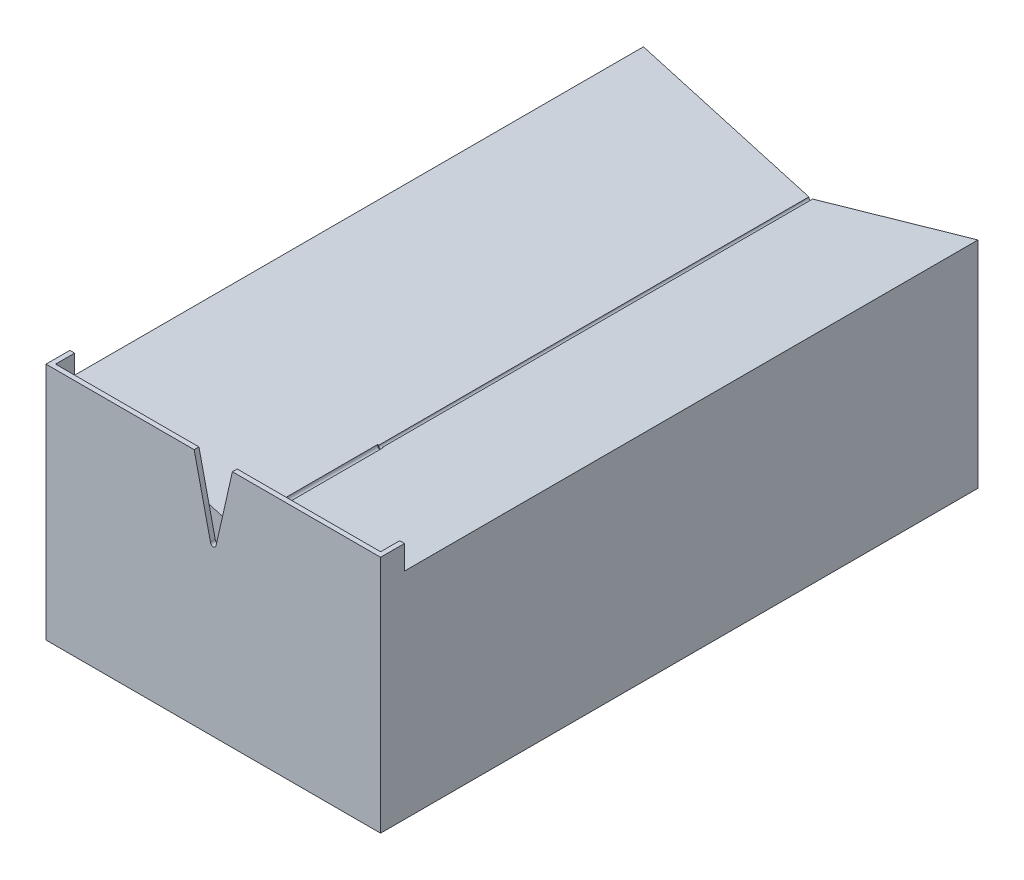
from build123d import *

# Parameters (mm, degrees)
RESSALTO_EXTRUS_O2_DEPTH = 120
ESBO_O2_W                = 70
ESBO_O2_H                = 50
RESSALTO_EXTRUS_O3_DEPTH = 5
ESBO_O3_W                = 68
ESBO_O3_H                = 4
CORTE_EXTRUS_O1_DEPTH    = 48
ESBO_O5_R                = 0.4
CORTE_EXTRUS_O4_DEPTH    = 127
ESBO_O6_R                = 0.6
CORTE_EXTRUS_O6_DEPTH    = 35
CORTE_EXTRUS_O7_DEPTH    = 4


with BuildPart() as part:
    # Esbo_o1 → Ressalto-extrus_o2 (new body)
    with BuildSketch(Plane.XY):
        with BuildLine():
            Line((35, -22.5), (-35, -22.5))
            Line((-35, -22.5), (-35, 22.5))
            Line((-35, 22.5), (-0.384609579, 12.609888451))
            ThreePointArc((-0.384609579, 12.609888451), (0, 12.1), (0.384609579, 12.609888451))
            Line((0.384609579, 12.609888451), (35, 22.5))
            Line((35, 22.5), (35, -22.5))
        make_face()
    extrude(amount=RESSALTO_EXTRUS_O2_DEPTH)

    # Esbo_o2 → Ressalto-extrus_o3 (add)
    with BuildSketch(Plane.XY.offset(120)):
        with Locations((0, 2.5)):
            Rectangle(ESBO_O2_W, ESBO_O2_H)
    extrude(amount=RESSALTO_EXTRUS_O3_DEPTH)

    # Esbo_o3 → Corte-extrus_o1 (cut)
    with BuildSketch(Plane(origin=(0, 27.5, 0), x_dir=(1, 0, 0), z_dir=(0, 1, 0))):
        with Locations((0, -122)):
            Rectangle(ESBO_O3_W, ESBO_O3_H)
    extrude(amount=-CORTE_EXTRUS_O1_DEPTH, mode=Mode.SUBTRACT)

    # Esbo_o5 → Corte-extrus_o4 (cut)
    with BuildSketch(Plane(origin=(0, 0, 0), x_dir=(-1, 0, 0), z_dir=(0, 0, -1))):
        with Locations((0, 12.5)):
            Circle(ESBO_O5_R)
    extrude(amount=-CORTE_EXTRUS_O4_DEPTH, mode=Mode.SUBTRACT)

    # Esbo_o6 → Corte-extrus_o6 (cut)
    with BuildSketch(Plane.XY.offset(125)):
        with Locations((0, 12.5)):
            Circle(ESBO_O6_R)
    extrude(amount=-CORTE_EXTRUS_O6_DEPTH, mode=Mode.SUBTRACT)

    # Esbo_o7 → Corte-extrus_o7 (cut)
    with BuildSketch(Plane.XY.offset(125)):
        Polygon((0.6, 12.5), (4, 27.5), (0, 27.5), (-4, 27.5), (-0.6, 12.5), align=None)
    extrude(amount=-CORTE_EXTRUS_O7_DEPTH, mode=Mode.SUBTRACT)


solid = part.part
